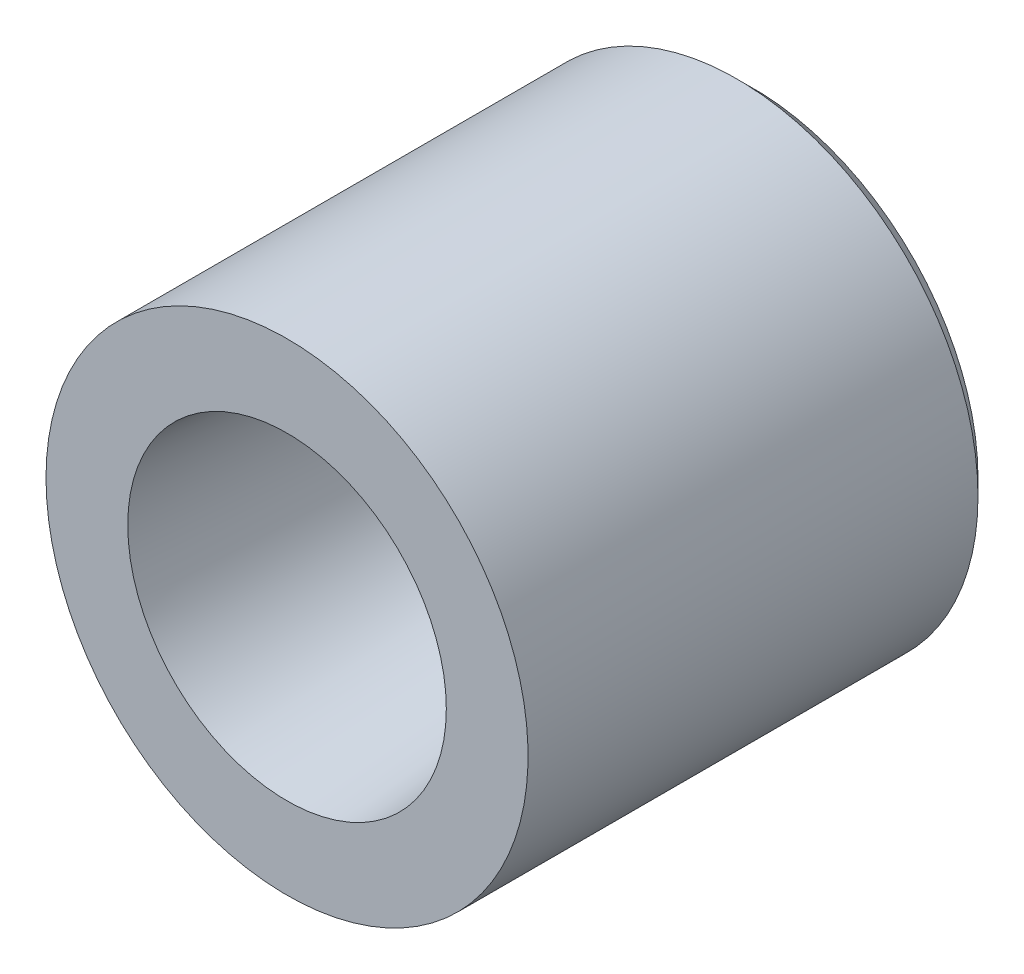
ISO-10303-21;
HEADER;
FILE_DESCRIPTION(('STEP AP214'),'2;1');
FILE_NAME('part.step','',(''),(''),'','','');
FILE_SCHEMA(('AUTOMOTIVE_DESIGN { 1 0 10303 214 1 1 1 1 }'));
ENDSEC;
DATA;
#1=APPLICATION_CONTEXT('core data for automotive mechanical design processes');
#2=APPLICATION_PROTOCOL_DEFINITION('international standard','automotive_design',2000,#1);
#3=PRODUCT_CONTEXT('',#1,'mechanical');
#4=PRODUCT('Part','Part','',(#3));
#5=PRODUCT_RELATED_PRODUCT_CATEGORY('part','',(#4));
#6=PRODUCT_DEFINITION_FORMATION('','',#4);
#7=PRODUCT_DEFINITION_CONTEXT('part definition',#1,'design');
#8=PRODUCT_DEFINITION('design','',#6,#7);
#9=PRODUCT_DEFINITION_SHAPE('','',#8);
#10=(LENGTH_UNIT() NAMED_UNIT(*) SI_UNIT(.MILLI.,.METRE.));
#11=(NAMED_UNIT(*) PLANE_ANGLE_UNIT() SI_UNIT($,.RADIAN.));
#12=(NAMED_UNIT(*) SI_UNIT($,.STERADIAN.) SOLID_ANGLE_UNIT());
#13=UNCERTAINTY_MEASURE_WITH_UNIT(LENGTH_MEASURE(1.E-05),#10,'distance_accuracy_value','');
#14=(GEOMETRIC_REPRESENTATION_CONTEXT(3) GLOBAL_UNCERTAINTY_ASSIGNED_CONTEXT((#13)) GLOBAL_UNIT_ASSIGNED_CONTEXT((#10,
#11,#12)) REPRESENTATION_CONTEXT('',''));
#15=CARTESIAN_POINT('',(0.,0.,0.));
#16=DIRECTION('',(0.,0.,1.));
#17=DIRECTION('',(1.,0.,0.));
#18=AXIS2_PLACEMENT_3D('',#15,#16,#17);
#19=CARTESIAN_POINT('',(0.,0.,-13.4014492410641));
#20=DIRECTION('',(0.,0.,1.));
#21=DIRECTION('',(1.,0.,0.));
#22=AXIS2_PLACEMENT_3D('',#19,#20,#21);
#23=CONICAL_SURFACE('',#22,12.2862208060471,0.785398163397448);
#24=CARTESIAN_POINT('',(-1.25693328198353E-13,0.,-18.));
#25=DIRECTION('',(0.,0.,1.));
#26=DIRECTION('',(-1.,0.,0.));
#27=AXIS2_PLACEMENT_3D('',#24,#25,#26);
#28=CIRCLE('',#27,7.68767004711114);
#29=CARTESIAN_POINT('',(7.68767004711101,0.,-18.));
#30=VERTEX_POINT('',#29);
#31=CARTESIAN_POINT('',(-7.68767004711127,0.,-18.));
#32=VERTEX_POINT('',#31);
#33=EDGE_CURVE('E143',#30,#32,#28,.T.);
#34=ORIENTED_EDGE('',*,*,#33,.F.);
#35=CARTESIAN_POINT('',(7.68766876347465,0.,-18.0000012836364));
#36=CARTESIAN_POINT('',(8.6876698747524,0.,-17.0000001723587));
#37=B_SPLINE_CURVE_WITH_KNOTS('',1,(#35,#36),.UNSPECIFIED.,.F.,.F.,(2,2),(0.625714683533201,
0.707106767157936),.UNSPECIFIED.);
#38=CARTESIAN_POINT('',(8.68767004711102,0.,-17.));
#39=VERTEX_POINT('',#38);
#40=EDGE_CURVE('E44',#30,#39,#37,.T.);
#41=ORIENTED_EDGE('',*,*,#40,.T.);
#42=CARTESIAN_POINT('',(-1.18710365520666E-13,0.,-17.));
#43=DIRECTION('',(0.,0.,-1.));
#44=DIRECTION('',(-1.,0.,0.));
#45=AXIS2_PLACEMENT_3D('',#42,#43,#44);
#46=CIRCLE('',#45,8.68767004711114);
#47=CARTESIAN_POINT('',(-8.68767004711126,0.,-17.));
#48=VERTEX_POINT('',#47);
#49=EDGE_CURVE('E11',#48,#39,#46,.T.);
#50=ORIENTED_EDGE('',*,*,#49,.F.);
#51=CARTESIAN_POINT('',(-1.18710365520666E-13,0.,-17.));
#52=DIRECTION('',(0.,0.,-1.));
#53=DIRECTION('',(-1.,0.,0.));
#54=AXIS2_PLACEMENT_3D('',#51,#52,#53);
#55=CIRCLE('',#54,8.68767004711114);
#56=EDGE_CURVE('E51',#39,#48,#55,.T.);
#57=ORIENTED_EDGE('',*,*,#56,.F.);
#58=ORIENTED_EDGE('',*,*,#40,.F.);
#59=CARTESIAN_POINT('',(-1.25693328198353E-13,0.,-18.));
#60=DIRECTION('',(0.,0.,1.));
#61=DIRECTION('',(-1.,0.,0.));
#62=AXIS2_PLACEMENT_3D('',#59,#60,#61);
#63=CIRCLE('',#62,7.68767004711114);
#64=EDGE_CURVE('E59',#32,#30,#63,.T.);
#65=ORIENTED_EDGE('',*,*,#64,.F.);
#66=EDGE_LOOP('',(#34,#41,#50,#57,#58,#65));
#67=FACE_BOUND('',#66,.T.);
#68=ADVANCED_FACE('F36',(#67),#23,.F.);
#69=CARTESIAN_POINT('',(-1.15218884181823E-13,0.,-16.5));
#70=DIRECTION('',(0.,0.,-1.));
#71=DIRECTION('',(-1.,0.,0.));
#72=AXIS2_PLACEMENT_3D('',#69,#70,#71);
#73=CYLINDRICAL_SURFACE('',#72,8.68767004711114);
#74=CARTESIAN_POINT('',(-1.04744440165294E-13,0.,-15.));
#75=DIRECTION('',(0.,0.,-1.));
#76=DIRECTION('',(-1.,0.,0.));
#77=AXIS2_PLACEMENT_3D('',#74,#75,#76);
#78=CIRCLE('',#77,8.68767004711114);
#79=CARTESIAN_POINT('',(-8.68767004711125,0.,-15.));
#80=VERTEX_POINT('',#79);
#81=EDGE_CURVE('E152',#80,#80,#78,.T.);
#82=ORIENTED_EDGE('',*,*,#81,.F.);
#83=CARTESIAN_POINT('',(-8.68767004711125,0.,-14.9999969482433));
#84=CARTESIAN_POINT('',(-8.68767004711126,0.,-17.0000020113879));
#85=B_SPLINE_CURVE_WITH_KNOTS('',1,(#83,#84),.UNSPECIFIED.,.F.,.F.,(2,2),(0.0833320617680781,
0.91666750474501),.UNSPECIFIED.);
#86=EDGE_CURVE('E147',#80,#48,#85,.T.);
#87=ORIENTED_EDGE('',*,*,#86,.T.);
#88=ORIENTED_EDGE('',*,*,#49,.T.);
#89=ORIENTED_EDGE('',*,*,#56,.T.);
#90=ORIENTED_EDGE('',*,*,#86,.F.);
#91=EDGE_LOOP('',(#82,#87,#88,#89,#90));
#92=FACE_BOUND('',#91,.T.);
#93=ADVANCED_FACE('F191',(#92),#73,.F.);
#94=CARTESIAN_POINT('',(17.6816411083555,-15.9785221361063,-18.));
#95=DIRECTION('',(0.,0.,-1.));
#96=DIRECTION('',(-1.,0.,0.));
#97=AXIS2_PLACEMENT_3D('',#94,#95,#96);
#98=PLANE('',#97);
#99=CARTESIAN_POINT('',(-2.09488880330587E-13,0.,-17.9999999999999));
#100=DIRECTION('',(0.,0.,-1.));
#101=DIRECTION('',(-1.,0.,0.));
#102=AXIS2_PLACEMENT_3D('',#99,#100,#101);
#103=CIRCLE('',#102,4.24999999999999);
#104=CARTESIAN_POINT('',(-4.2500000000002,0.,-17.9999999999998));
#105=VERTEX_POINT('',#104);
#106=EDGE_CURVE('E103',#105,#105,#103,.T.);
#107=ORIENTED_EDGE('',*,*,#106,.T.);
#108=EDGE_LOOP('',(#107));
#109=FACE_BOUND('',#108,.T.);
#110=ORIENTED_EDGE('',*,*,#64,.T.);
#111=ORIENTED_EDGE('',*,*,#33,.T.);
#112=EDGE_LOOP('',(#110,#111));
#113=FACE_BOUND('',#112,.T.);
#114=ADVANCED_FACE('F193',(#109,#113),#98,.F.);
#115=CARTESIAN_POINT('',(0.,0.,-1.));
#116=DIRECTION('',(0.,0.,1.));
#117=DIRECTION('',(-1.,0.,0.));
#118=AXIS2_PLACEMENT_3D('',#115,#116,#117);
#119=CONICAL_SURFACE('',#118,9.91251133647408,0.0872664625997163);
#120=ORIENTED_EDGE('',*,*,#81,.T.);
#121=CARTESIAN_POINT('',(-8.68767004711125,0.,-15.));
#122=CARTESIAN_POINT('',(-9.91251133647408,0.,-0.999999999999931));
#123=B_SPLINE_CURVE_WITH_KNOTS('',1,(#121,#122),.UNSPECIFIED.,.F.,.F.,(2,2),(0.,1.),.UNSPECIFIED.);
#124=CARTESIAN_POINT('',(-9.91251133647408,0.,-0.999999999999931));
#125=VERTEX_POINT('',#124);
#126=EDGE_CURVE('E108',#80,#125,#123,.T.);
#127=ORIENTED_EDGE('',*,*,#126,.T.);
#128=CARTESIAN_POINT('',(0.,0.,-1.));
#129=DIRECTION('',(0.,0.,-1.));
#130=DIRECTION('',(1.,0.,0.));
#131=AXIS2_PLACEMENT_3D('',#128,#129,#130);
#132=CIRCLE('',#131,9.91251133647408);
#133=CARTESIAN_POINT('',(9.91251133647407,0.,-1.00000000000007));
#134=VERTEX_POINT('',#133);
#135=EDGE_CURVE('E133',#134,#125,#132,.T.);
#136=ORIENTED_EDGE('',*,*,#135,.F.);
#137=CARTESIAN_POINT('',(0.,0.,-1.));
#138=DIRECTION('',(0.,0.,-1.));
#139=DIRECTION('',(1.,0.,0.));
#140=AXIS2_PLACEMENT_3D('',#137,#138,#139);
#141=CIRCLE('',#140,9.91251133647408);
#142=EDGE_CURVE('E126',#125,#134,#141,.T.);
#143=ORIENTED_EDGE('',*,*,#142,.F.);
#144=ORIENTED_EDGE('',*,*,#126,.F.);
#145=EDGE_LOOP('',(#120,#127,#136,#143,#144));
#146=FACE_BOUND('',#145,.T.);
#147=ADVANCED_FACE('F189',(#146),#119,.F.);
#148=CARTESIAN_POINT('',(-1.5911934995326E-13,0.,-22.7867965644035));
#149=DIRECTION('',(0.,0.,1.));
#150=DIRECTION('',(1.,0.,0.));
#151=AXIS2_PLACEMENT_3D('',#148,#149,#150);
#152=CONICAL_SURFACE('',#151,21.2132034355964,0.785398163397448);
#153=CARTESIAN_POINT('',(-2.09488880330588E-13,0.,-30.));
#154=DIRECTION('',(0.,0.,1.));
#155=DIRECTION('',(-1.,0.,0.));
#156=AXIS2_PLACEMENT_3D('',#153,#154,#155);
#157=CIRCLE('',#156,14.);
#158=CARTESIAN_POINT('',(-14.0000000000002,0.,-30.));
#159=VERTEX_POINT('',#158);
#160=CARTESIAN_POINT('',(13.9999999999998,0.,-30.));
#161=VERTEX_POINT('',#160);
#162=EDGE_CURVE('E90',#159,#161,#157,.T.);
#163=ORIENTED_EDGE('',*,*,#162,.T.);
#164=CARTESIAN_POINT('',(14.0000009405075,0.,-29.9999990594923));
#165=CARTESIAN_POINT('',(15.0000023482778,0.,-28.9999976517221));
#166=B_SPLINE_CURVE_WITH_KNOTS('',1,(#164,#165),.UNSPECIFIED.,.F.,.F.,(2,2),(0.659966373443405,
0.707106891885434),.UNSPECIFIED.);
#167=CARTESIAN_POINT('',(14.9999999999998,0.,-29.));
#168=VERTEX_POINT('',#167);
#169=EDGE_CURVE('E95',#161,#168,#166,.T.);
#170=ORIENTED_EDGE('',*,*,#169,.T.);
#171=CARTESIAN_POINT('',(-2.02505917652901E-13,0.,-29.));
#172=DIRECTION('',(0.,0.,-1.));
#173=DIRECTION('',(-1.,0.,0.));
#174=AXIS2_PLACEMENT_3D('',#171,#172,#173);
#175=CIRCLE('',#174,15.);
#176=CARTESIAN_POINT('',(-15.,0.,-29.));
#177=VERTEX_POINT('',#176);
#178=EDGE_CURVE('E102',#168,#177,#175,.T.);
#179=ORIENTED_EDGE('',*,*,#178,.T.);
#180=CARTESIAN_POINT('',(-2.02505917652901E-13,0.,-29.));
#181=DIRECTION('',(0.,0.,-1.));
#182=DIRECTION('',(-1.,0.,0.));
#183=AXIS2_PLACEMENT_3D('',#180,#181,#182);
#184=CIRCLE('',#183,15.);
#185=EDGE_CURVE('E105',#177,#168,#184,.T.);
#186=ORIENTED_EDGE('',*,*,#185,.T.);
#187=ORIENTED_EDGE('',*,*,#169,.F.);
#188=CARTESIAN_POINT('',(-2.09488880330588E-13,0.,-30.));
#189=DIRECTION('',(0.,0.,1.));
#190=DIRECTION('',(-1.,0.,0.));
#191=AXIS2_PLACEMENT_3D('',#188,#189,#190);
#192=CIRCLE('',#191,14.);
#193=EDGE_CURVE('E97',#161,#159,#192,.T.);
#194=ORIENTED_EDGE('',*,*,#193,.T.);
#195=EDGE_LOOP('',(#163,#170,#179,#186,#187,#194));
#196=FACE_BOUND('',#195,.T.);
#197=ADVANCED_FACE('F92',(#196),#152,.T.);
#198=CARTESIAN_POINT('',(-1.08235921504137E-13,0.,-15.5));
#199=DIRECTION('',(0.,0.,-1.));
#200=DIRECTION('',(-1.,0.,0.));
#201=AXIS2_PLACEMENT_3D('',#198,#199,#200);
#202=CYLINDRICAL_SURFACE('',#201,15.);
#203=CARTESIAN_POINT('',(0.,0.,-1.));
#204=DIRECTION('',(0.,0.,1.));
#205=DIRECTION('',(-1.,0.,0.));
#206=AXIS2_PLACEMENT_3D('',#203,#204,#205);
#207=CIRCLE('',#206,15.);
#208=CARTESIAN_POINT('',(-15.,0.,-0.999999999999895));
#209=VERTEX_POINT('',#208);
#210=EDGE_CURVE('E99',#209,#209,#207,.T.);
#211=ORIENTED_EDGE('',*,*,#210,.F.);
#212=CARTESIAN_POINT('',(-15.,0.,-0.99999893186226));
#213=CARTESIAN_POINT('',(-15.,0.,-28.9999996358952));
#214=B_SPLINE_CURVE_WITH_KNOTS('',1,(#212,#213),.UNSPECIFIED.,.F.,.F.,(2,2),(0.0833333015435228,
0.916666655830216),.UNSPECIFIED.);
#215=EDGE_CURVE('E173',#209,#177,#214,.T.);
#216=ORIENTED_EDGE('',*,*,#215,.T.);
#217=ORIENTED_EDGE('',*,*,#178,.F.);
#218=ORIENTED_EDGE('',*,*,#185,.F.);
#219=ORIENTED_EDGE('',*,*,#215,.F.);
#220=EDGE_LOOP('',(#211,#216,#217,#218,#219));
#221=FACE_BOUND('',#220,.T.);
#222=ADVANCED_FACE('F225',(#221),#202,.T.);
#223=CARTESIAN_POINT('',(32.2,-29.0984535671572,-30.));
#224=DIRECTION('',(0.,0.,-1.));
#225=DIRECTION('',(-1.,0.,0.));
#226=AXIS2_PLACEMENT_3D('',#223,#224,#225);
#227=PLANE('',#226);
#228=CARTESIAN_POINT('',(-2.09488880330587E-13,0.,-29.9999999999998));
#229=DIRECTION('',(0.,0.,-1.));
#230=DIRECTION('',(-1.,0.,0.));
#231=AXIS2_PLACEMENT_3D('',#228,#229,#230);
#232=CIRCLE('',#231,4.24999999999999);
#233=CARTESIAN_POINT('',(-4.2500000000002,0.,-29.9999999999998));
#234=VERTEX_POINT('',#233);
#235=EDGE_CURVE('E275',#234,#234,#232,.T.);
#236=ORIENTED_EDGE('',*,*,#235,.F.);
#237=EDGE_LOOP('',(#236));
#238=FACE_BOUND('',#237,.T.);
#239=ORIENTED_EDGE('',*,*,#193,.F.);
#240=ORIENTED_EDGE('',*,*,#162,.F.);
#241=EDGE_LOOP('',(#239,#240));
#242=FACE_BOUND('',#241,.T.);
#243=ADVANCED_FACE('F101',(#238,#242),#227,.T.);
#244=CARTESIAN_POINT('',(-19.5,-31.1769145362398,-0.999999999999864));
#245=DIRECTION('',(0.,0.,1.));
#246=DIRECTION('',(1.,0.,0.));
#247=AXIS2_PLACEMENT_3D('',#244,#245,#246);
#248=PLANE('',#247);
#249=ORIENTED_EDGE('',*,*,#210,.T.);
#250=EDGE_LOOP('',(#249));
#251=FACE_BOUND('',#250,.T.);
#252=ORIENTED_EDGE('',*,*,#135,.T.);
#253=ORIENTED_EDGE('',*,*,#142,.T.);
#254=EDGE_LOOP('',(#252,#253));
#255=FACE_BOUND('',#254,.T.);
#256=ADVANCED_FACE('F240',(#251,#255),#248,.T.);
#257=CARTESIAN_POINT('',(-2.09488880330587E-13,0.,-29.9999999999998));
#258=DIRECTION('',(0.,0.,-1.));
#259=DIRECTION('',(-1.,0.,0.));
#260=AXIS2_PLACEMENT_3D('',#257,#258,#259);
#261=CYLINDRICAL_SURFACE('',#260,4.24999999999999);
#262=ORIENTED_EDGE('',*,*,#235,.T.);
#263=EDGE_LOOP('',(#262));
#264=FACE_BOUND('',#263,.T.);
#265=ORIENTED_EDGE('',*,*,#106,.F.);
#266=EDGE_LOOP('',(#265));
#267=FACE_BOUND('',#266,.T.);
#268=ADVANCED_FACE('F248',(#264,#267),#261,.F.);
#269=CLOSED_SHELL('',(#68,#93,#114,#147,#197,#222,#243,#256,#268));
#270=MANIFOLD_SOLID_BREP('B2',#269);
#271=ADVANCED_BREP_SHAPE_REPRESENTATION('',(#18,#270),#14);
#272=SHAPE_DEFINITION_REPRESENTATION(#9,#271);
ENDSEC;
END-ISO-10303-21;
